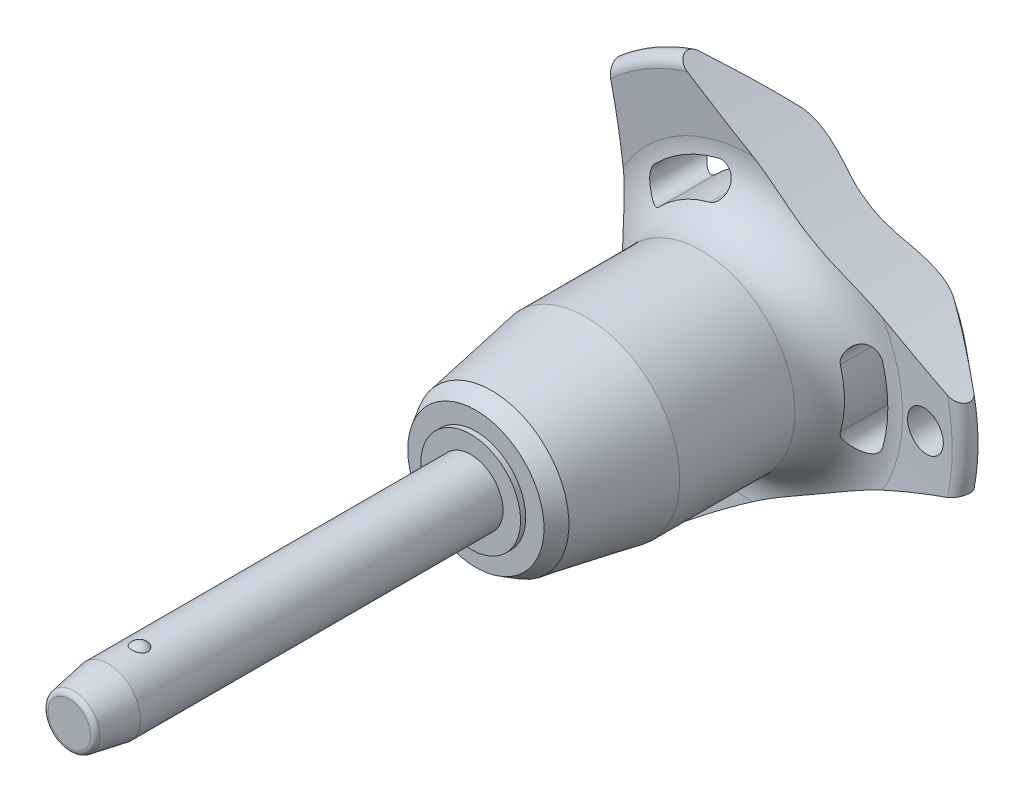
from build123d import *

# Parameters (mm, degrees)
SKETCH1_R           = 2.5
BOSS_EXTRUDE1_DEPTH = 25
SKETCH2_R           = 2.1
BOSS_EXTRUDE2_DEPTH = 26.7
BOSS_EXTRUDE3_START = 6
SKETCH1_2_R         = 2.5
BOSS_EXTRUDE3_DEPTH = 6
CHAMFER1_SIZE       = 3
CHAMFER1_SIZE2      = 0.528980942
FILLET1_R           = 0.4
SKETCH6_R           = 79.96
CUT_EXTRUDE1_DEPTH  = 57.781042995
CIRPATTERN1_COUNT   = 3
SKETCH7_R           = 1.5
CUT_EXTRUDE2_DEPTH  = 57.512343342


with BuildPart() as part:
    # Sketch1 → Boss-Extrude1 (new body)
    with BuildSketch(Plane.XY):
        Circle(SKETCH1_R)
    extrude(amount=-BOSS_EXTRUDE1_DEPTH)

    # Sketch2 → Boss-Extrude2 (add)
    with BuildSketch(Plane(origin=(0, 0, -25), x_dir=(-1, 0, 0), z_dir=(0, 0, -1))):
        Circle(SKETCH2_R)
    extrude(amount=BOSS_EXTRUDE2_DEPTH)

    # Sketch3 → Revolve1 (revolve)
    with BuildSketch(Plane(origin=(0, 0, 0), x_dir=(0, 0, -1), z_dir=(1, 0, 0))):
        with BuildLine():
            Line((-0.580947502, 2.75), (-0.580947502, 1.15))
            ThreePointArc((-0.580947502, 1.15), (0.219052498, 1.95), (-0.580947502, 2.75))
        make_face()
        with BuildLine():
            Line((-0.580947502, -1.15), (-0.580947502, -2.75))
            ThreePointArc((-0.580947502, -2.75), (0.219052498, -1.95), (-0.580947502, -1.15))
        make_face()
    revolve(axis=Axis((0, -1.15, 0.580947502), (0, 1, 0)))

    # Sketch1_2 → Boss-Extrude3 (add)
    with BuildSketch(Plane.XY.offset(BOSS_EXTRUDE3_START)):
        Circle(SKETCH1_2_R)
    extrude(amount=-BOSS_EXTRUDE3_DEPTH)

    # Chamfer1
    chamfer1_edges = [part.edges().sort_by_distance(p)[0] for p in [
        (-2.5, 0, 6),
    ]]
    chamfer1_side = [part.faces().sort_by_distance(p)[0] for p in [
        (-2.5, 0, -9.5),
    ]]
    chamfer(chamfer1_edges, length=CHAMFER1_SIZE, length2=CHAMFER1_SIZE2, reference=chamfer1_side[0])

    # Fillet1
    fillet1_edges = [part.edges().sort_by_distance(p)[0] for p in [
        (-1.971019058, 0, 6),
        (2.1, 0, -51.7),
    ]]
    fillet(fillet1_edges, radius=FILLET1_R)

    # Sketch4 → Revolve2 (revolve)
    with BuildSketch(Plane(origin=(0, 0, 0), x_dir=(0, 0, -1), z_dir=(1, 0, 0)), mode=Mode.PRIVATE) as revolve2_sk:
        Polygon((25, 0), (25, 3.851837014), (25.4, 3.851837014), (25.4, 5.26161122), (26.620900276, 5.966498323), (33.9, 7.25), (42.8, 7.25), (42.8, 0), align=None)
    revolve(revolve2_sk.sketch.rotate(Axis((0, 0, -42.8), (0, 0, 1)), 90), axis=Axis((0, 0, -42.8), (0, 0, 1)))

    # Sketch5 → Revolve3 (revolve)
    with BuildSketch(Plane(origin=(0, 0, 0), x_dir=(0, 0, -1), z_dir=(1, 0, 0)), mode=Mode.PRIVATE) as revolve3_sk:
        with BuildLine():
            Line((46.78715932, 11.570250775), (46.452568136, 15.735949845))
            ThreePointArc((46.452568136, 15.735949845), (46.946485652, 16.540188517), (47.862835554, 16.314230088))
            Line((47.862835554, 16.314230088), (51.326414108, 12.186497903))
            ThreePointArc((51.326414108, 12.186497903), (51.7, 11.109282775), (51.261488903, 10.056825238))
            ThreePointArc((51.261488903, 10.056825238), (48.289873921, 5.413681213), (47.25, 0))
            Line((47.25, 0), (42.8, 0))
            Line((42.8, 0), (42.8, 7.25))
            ThreePointArc((42.8, 7.25), (45.739473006, 8.537160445), (46.78715932, 11.570250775))
        make_face()
    revolve(revolve3_sk.sketch.rotate(Axis((0, 0, -47.25), (0, 0, 1)), 90), axis=Axis((0, 0, -47.25), (0, 0, 1)))

    # Sketch6 → Cut-Extrude1 (cut, through all)
    with BuildSketch(Plane.XY):
        with Locations((-89.76, 0)):
            Circle(SKETCH6_R)
        with BuildLine():
            ThreePointArc((10.099921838, -2.834717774), (10.490188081, 0), (10.099921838, 2.834717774))
            ThreePointArc((10.099921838, 2.834717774), (8.768180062, 3.582738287), (8.020159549, 2.250996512))
            ThreePointArc((8.020159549, 2.250996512), (8.330062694, 0), (8.020159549, -2.250996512))
            ThreePointArc((8.020159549, -2.250996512), (8.768180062, -3.582738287), (10.099921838, -2.834717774))
        make_face()
    cut_extrude1 = extrude(amount=-CUT_EXTRUDE1_DEPTH, mode=Mode.SUBTRACT)

    # CirPattern1: Cut-Extrude1 ×3 about axis
    cirpattern1_axis = Axis((0, 0, 0), (0, 0, 1))
    for i in range(1, CIRPATTERN1_COUNT):
        add(cut_extrude1.rotate(cirpattern1_axis, i * 360 / CIRPATTERN1_COUNT), mode=Mode.SUBTRACT)

    # Sketch7 → Cut-Extrude2 (cut, through all)
    with BuildSketch(Plane.XY):
        with Locations(Location((13.490188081, 0, 0), (0, 0, 225.221865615))):
            Circle(SKETCH7_R)
    extrude(amount=-CUT_EXTRUDE2_DEPTH, mode=Mode.SUBTRACT)


solid = part.part
